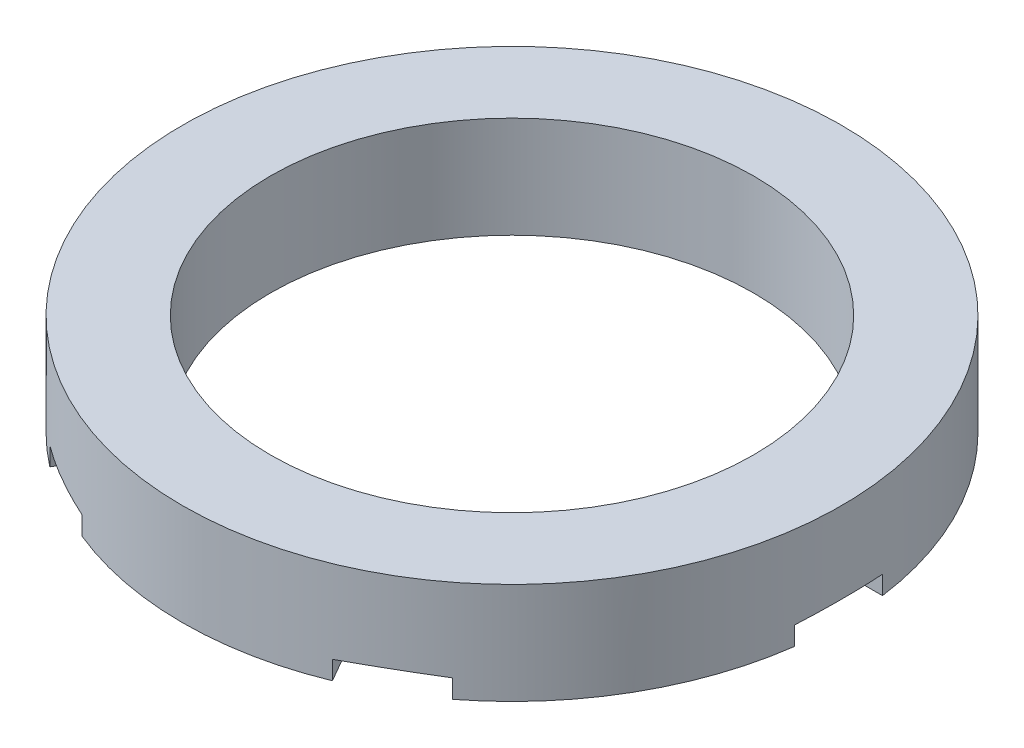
from build123d import *

# Parameters (mm, degrees)
ESQUISSE1_R                  = 37.5
ESQUISSE1_R_2                = 27.5
EXTRUSION1_DEPTH             = 11.54
EXTRUSION2_DEPTH             = 5
R_P_TITION_CIRCULAIRE1_COUNT = 6


with BuildPart() as part:
    # Esquisse1 → Extrusion1 (new body)
    with BuildSketch(Plane(origin=(0, 0, 0), x_dir=(1, 0, 0), z_dir=(0, 1, 0))):
        with Locations(Location((0, 0, 0), (0, 0, 270))):
            Circle(ESQUISSE1_R)
        with Locations(Location((0, 0, 0), (0, 0, 270))):
            Circle(ESQUISSE1_R_2, mode=Mode.SUBTRACT)
    extrude(amount=EXTRUSION1_DEPTH)

    # Esquisse2 → Extrusion2 (cut, symmetric)
    with BuildSketch(Plane.XY):
        Polygon((-37.5, 2.31), (-33.498962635, 0), (-37.5, 0), align=None)
    extrusion2 = extrude(amount=EXTRUSION2_DEPTH, both=True, mode=Mode.SUBTRACT)

    # R_p_tition circulaire1: Extrusion2 ×6 about axis
    r_p_tition_circulaire1_axis = Axis((0, 0, 0), (0, 1, 0))
    for i in range(1, R_P_TITION_CIRCULAIRE1_COUNT):
        add(extrusion2.rotate(r_p_tition_circulaire1_axis, i * 360 / R_P_TITION_CIRCULAIRE1_COUNT), mode=Mode.SUBTRACT)


solid = part.part
